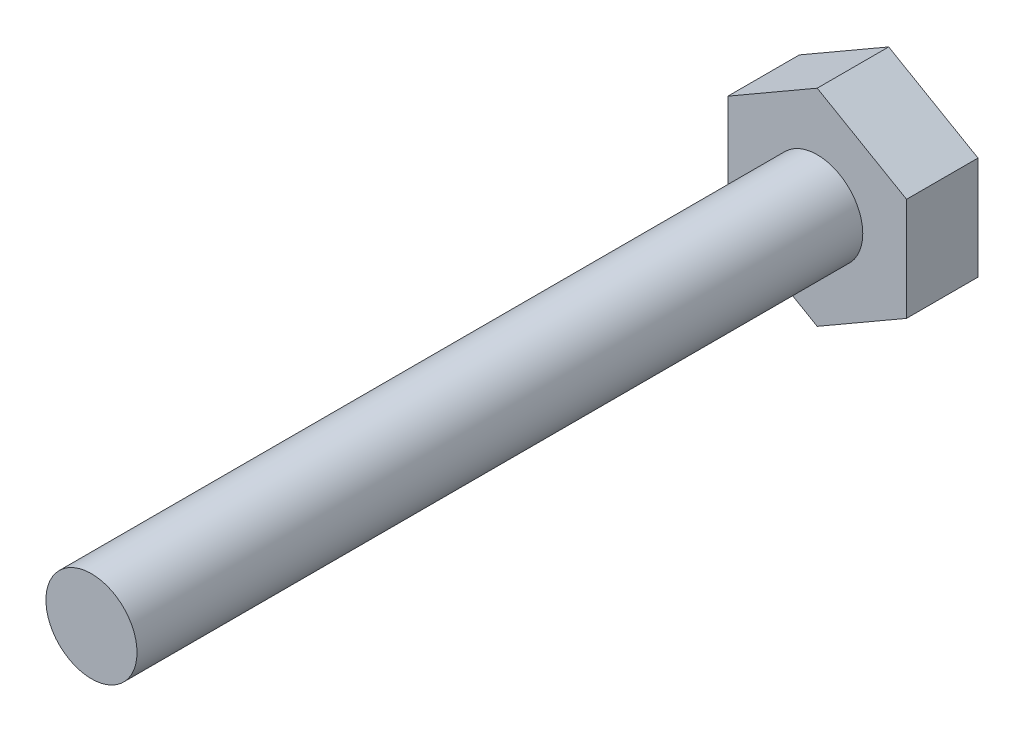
from build123d import *

# Parameters (mm, degrees)
SKIZZE6_W                       = 65
SKIZZE6_H                       = 4.08
AUFSATZ_LINEAR_AUSTRAGEN2_DEPTH = 6.4


with BuildPart() as part:
    # Skizze6 → Basis-Rotation (revolve)
    with BuildSketch(Plane(origin=(0, 0, 0), x_dir=(0, 0, -1), z_dir=(1, 0, 0)), mode=Mode.PRIVATE) as basis_rotation_sk:
        with Locations((-32.5, 2.04)):
            Rectangle(SKIZZE6_W, SKIZZE6_H)
    revolve(basis_rotation_sk.sketch.rotate(Axis((0, 0, 65.723959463), (0, 0, -1)), 90), axis=Axis((0, 0, 65.723959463), (0, 0, -1)))

    # Skizze7 → Aufsatz-Linear austragen2 (add)
    with BuildSketch(Plane.XY.offset(-6.4)):
        Polygon((-8, -4.618802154), (0, -9.237604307), (8, -4.618802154), (8, 4.618802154), (0, 9.237604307), (-8, 4.618802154), align=None)
    extrude(amount=AUFSATZ_LINEAR_AUSTRAGEN2_DEPTH)


solid = part.part
